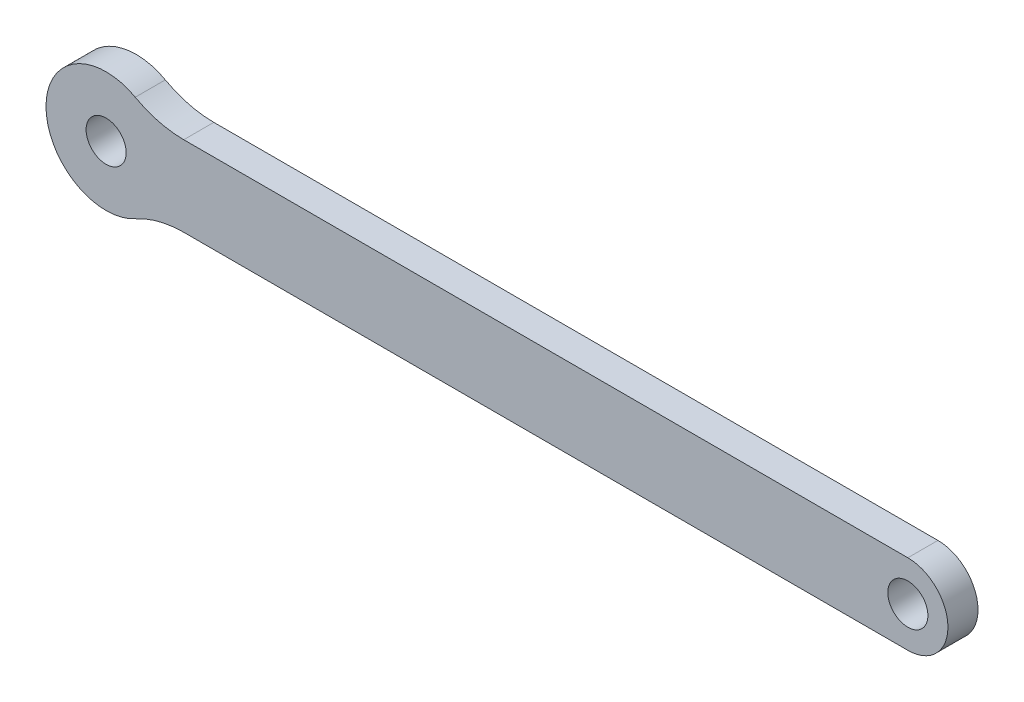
ISO-10303-21;
HEADER;
FILE_DESCRIPTION(('STEP AP214'),'2;1');
FILE_NAME('part.step','',(''),(''),'','','');
FILE_SCHEMA(('AUTOMOTIVE_DESIGN { 1 0 10303 214 1 1 1 1 }'));
ENDSEC;
DATA;
#1=APPLICATION_CONTEXT('core data for automotive mechanical design processes');
#2=APPLICATION_PROTOCOL_DEFINITION('international standard','automotive_design',2000,#1);
#3=PRODUCT_CONTEXT('',#1,'mechanical');
#4=PRODUCT('Part','Part','',(#3));
#5=PRODUCT_RELATED_PRODUCT_CATEGORY('part','',(#4));
#6=PRODUCT_DEFINITION_FORMATION('','',#4);
#7=PRODUCT_DEFINITION_CONTEXT('part definition',#1,'design');
#8=PRODUCT_DEFINITION('design','',#6,#7);
#9=PRODUCT_DEFINITION_SHAPE('','',#8);
#10=(LENGTH_UNIT() NAMED_UNIT(*) SI_UNIT(.MILLI.,.METRE.));
#11=(NAMED_UNIT(*) PLANE_ANGLE_UNIT() SI_UNIT($,.RADIAN.));
#12=(NAMED_UNIT(*) SI_UNIT($,.STERADIAN.) SOLID_ANGLE_UNIT());
#13=UNCERTAINTY_MEASURE_WITH_UNIT(LENGTH_MEASURE(1.E-05),#10,'distance_accuracy_value','');
#14=(GEOMETRIC_REPRESENTATION_CONTEXT(3) GLOBAL_UNCERTAINTY_ASSIGNED_CONTEXT((#13)) GLOBAL_UNIT_ASSIGNED_CONTEXT((#10,
#11,#12)) REPRESENTATION_CONTEXT('',''));
#15=CARTESIAN_POINT('',(0.,0.,0.));
#16=DIRECTION('',(0.,0.,1.));
#17=DIRECTION('',(1.,0.,0.));
#18=AXIS2_PLACEMENT_3D('',#15,#16,#17);
#19=CARTESIAN_POINT('',(126.393109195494,47.5642070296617,0.));
#20=DIRECTION('',(0.,0.,-1.));
#21=DIRECTION('',(-1.,0.,0.));
#22=AXIS2_PLACEMENT_3D('',#19,#20,#21);
#23=PLANE('',#22);
#24=CARTESIAN_POINT('',(198.647142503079,61.5642070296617,0.));
#25=DIRECTION('',(0.,0.,1.));
#26=DIRECTION('',(1.,0.,0.));
#27=AXIS2_PLACEMENT_3D('',#24,#25,#26);
#28=CIRCLE('',#27,2.);
#29=CARTESIAN_POINT('',(200.647142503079,61.5642070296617,0.));
#30=VERTEX_POINT('',#29);
#31=EDGE_CURVE('E148',#30,#30,#28,.T.);
#32=ORIENTED_EDGE('',*,*,#31,.T.);
#33=EDGE_LOOP('',(#32));
#34=FACE_BOUND('',#33,.T.);
#35=CARTESIAN_POINT('',(118.647142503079,61.5642070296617,0.));
#36=DIRECTION('',(0.,0.,1.));
#37=DIRECTION('',(1.,0.,0.));
#38=AXIS2_PLACEMENT_3D('',#35,#36,#37);
#39=CIRCLE('',#38,2.);
#40=CARTESIAN_POINT('',(120.647142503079,61.5642070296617,0.));
#41=VERTEX_POINT('',#40);
#42=EDGE_CURVE('E95',#41,#41,#39,.T.);
#43=ORIENTED_EDGE('',*,*,#42,.T.);
#44=EDGE_LOOP('',(#43));
#45=FACE_BOUND('',#44,.T.);
#46=CARTESIAN_POINT('',(198.647142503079,61.5642070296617,0.));
#47=DIRECTION('',(0.,0.,-1.));
#48=DIRECTION('',(-1.,0.,0.));
#49=AXIS2_PLACEMENT_3D('',#46,#47,#48);
#50=CIRCLE('',#49,4.);
#51=CARTESIAN_POINT('',(198.647142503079,57.5642070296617,0.));
#52=VERTEX_POINT('',#51);
#53=CARTESIAN_POINT('',(198.647142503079,65.5642070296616,0.));
#54=VERTEX_POINT('',#53);
#55=EDGE_CURVE('E115',#52,#54,#50,.F.);
#56=ORIENTED_EDGE('',*,*,#55,.F.);
#57=DIRECTION('',(-1.,0.,0.));
#58=VECTOR('',#57,1.);
#59=CARTESIAN_POINT('',(126.393109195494,57.5642070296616,0.));
#60=LINE('',#59,#58);
#61=CARTESIAN_POINT('',(126.393109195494,57.5642070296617,0.));
#62=VERTEX_POINT('',#61);
#63=EDGE_CURVE('E109',#52,#62,#60,.T.);
#64=ORIENTED_EDGE('',*,*,#63,.T.);
#65=CARTESIAN_POINT('',(126.393109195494,47.5642070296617,0.));
#66=DIRECTION('',(0.,0.,-1.));
#67=DIRECTION('',(-1.,0.,0.));
#68=AXIS2_PLACEMENT_3D('',#65,#66,#67);
#69=CIRCLE('',#68,10.);
#70=CARTESIAN_POINT('',(121.551880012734,56.3142070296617,0.));
#71=VERTEX_POINT('',#70);
#72=EDGE_CURVE('E89',#62,#71,#69,.F.);
#73=ORIENTED_EDGE('',*,*,#72,.T.);
#74=CARTESIAN_POINT('',(118.647142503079,61.5642070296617,0.));
#75=DIRECTION('',(0.,0.,-1.));
#76=DIRECTION('',(-1.,0.,0.));
#77=AXIS2_PLACEMENT_3D('',#74,#75,#76);
#78=CIRCLE('',#77,6.00000000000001);
#79=CARTESIAN_POINT('',(112.647142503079,61.5642070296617,0.));
#80=VERTEX_POINT('',#79);
#81=EDGE_CURVE('E33',#80,#71,#78,.F.);
#82=ORIENTED_EDGE('',*,*,#81,.F.);
#83=CARTESIAN_POINT('',(118.647142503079,61.5642070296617,0.));
#84=DIRECTION('',(0.,0.,-1.));
#85=DIRECTION('',(-1.,0.,0.));
#86=AXIS2_PLACEMENT_3D('',#83,#84,#85);
#87=CIRCLE('',#86,6.00000000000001);
#88=CARTESIAN_POINT('',(121.551880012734,66.8142070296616,0.));
#89=VERTEX_POINT('',#88);
#90=EDGE_CURVE('E87',#89,#80,#87,.F.);
#91=ORIENTED_EDGE('',*,*,#90,.F.);
#92=CARTESIAN_POINT('',(126.393109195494,75.5642070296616,0.));
#93=DIRECTION('',(0.,0.,-1.));
#94=DIRECTION('',(-1.,0.,0.));
#95=AXIS2_PLACEMENT_3D('',#92,#93,#94);
#96=CIRCLE('',#95,10.);
#97=CARTESIAN_POINT('',(126.393109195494,65.5642070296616,0.));
#98=VERTEX_POINT('',#97);
#99=EDGE_CURVE('E131',#89,#98,#96,.F.);
#100=ORIENTED_EDGE('',*,*,#99,.T.);
#101=DIRECTION('',(1.,0.,0.));
#102=VECTOR('',#101,1.);
#103=CARTESIAN_POINT('',(198.647142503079,65.5642070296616,0.));
#104=LINE('',#103,#102);
#105=EDGE_CURVE('E113',#98,#54,#104,.T.);
#106=ORIENTED_EDGE('',*,*,#105,.T.);
#107=EDGE_LOOP('',(#56,#64,#73,#82,#91,#100,#106));
#108=FACE_BOUND('',#107,.T.);
#109=ADVANCED_FACE('F30',(#34,#45,#108),#23,.T.);
#110=CARTESIAN_POINT('',(118.647142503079,61.5642070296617,3.));
#111=DIRECTION('',(0.,0.,-1.));
#112=DIRECTION('',(-1.,0.,0.));
#113=AXIS2_PLACEMENT_3D('',#110,#111,#112);
#114=CYLINDRICAL_SURFACE('',#113,6.00000000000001);
#115=ORIENTED_EDGE('',*,*,#81,.T.);
#116=DIRECTION('',(0.,0.,-1.));
#117=VECTOR('',#116,1.);
#118=CARTESIAN_POINT('',(121.551880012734,56.3142070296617,3.));
#119=LINE('',#118,#117);
#120=CARTESIAN_POINT('',(121.551880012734,56.3142070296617,3.));
#121=VERTEX_POINT('',#120);
#122=EDGE_CURVE('E111',#71,#121,#119,.F.);
#123=ORIENTED_EDGE('',*,*,#122,.T.);
#124=CARTESIAN_POINT('',(118.647142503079,61.5642070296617,3.));
#125=DIRECTION('',(0.,0.,-1.));
#126=DIRECTION('',(-1.,0.,0.));
#127=AXIS2_PLACEMENT_3D('',#124,#125,#126);
#128=CIRCLE('',#127,6.00000000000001);
#129=CARTESIAN_POINT('',(112.647142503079,61.5642070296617,3.));
#130=VERTEX_POINT('',#129);
#131=EDGE_CURVE('E104',#121,#130,#128,.T.);
#132=ORIENTED_EDGE('',*,*,#131,.T.);
#133=DIRECTION('',(0.,0.,-1.));
#134=VECTOR('',#133,1.);
#135=CARTESIAN_POINT('',(112.647142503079,61.5642070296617,3.));
#136=LINE('',#135,#134);
#137=EDGE_CURVE('E94',#80,#130,#136,.F.);
#138=ORIENTED_EDGE('',*,*,#137,.F.);
#139=EDGE_LOOP('',(#115,#123,#132,#138));
#140=FACE_BOUND('',#139,.T.);
#141=ADVANCED_FACE('F103',(#140),#114,.T.);
#142=CARTESIAN_POINT('',(118.647142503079,61.5642070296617,3.));
#143=DIRECTION('',(0.,0.,-1.));
#144=DIRECTION('',(-1.,0.,0.));
#145=AXIS2_PLACEMENT_3D('',#142,#143,#144);
#146=CYLINDRICAL_SURFACE('',#145,6.00000000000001);
#147=DIRECTION('',(0.,0.,-1.));
#148=VECTOR('',#147,1.);
#149=CARTESIAN_POINT('',(121.551880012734,66.8142070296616,3.));
#150=LINE('',#149,#148);
#151=CARTESIAN_POINT('',(121.551880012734,66.8142070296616,3.));
#152=VERTEX_POINT('',#151);
#153=EDGE_CURVE('E101',#152,#89,#150,.T.);
#154=ORIENTED_EDGE('',*,*,#153,.T.);
#155=ORIENTED_EDGE('',*,*,#90,.T.);
#156=ORIENTED_EDGE('',*,*,#137,.T.);
#157=CARTESIAN_POINT('',(118.647142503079,61.5642070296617,3.));
#158=DIRECTION('',(0.,0.,-1.));
#159=DIRECTION('',(-1.,0.,0.));
#160=AXIS2_PLACEMENT_3D('',#157,#158,#159);
#161=CIRCLE('',#160,6.00000000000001);
#162=EDGE_CURVE('E125',#130,#152,#161,.T.);
#163=ORIENTED_EDGE('',*,*,#162,.T.);
#164=EDGE_LOOP('',(#154,#155,#156,#163));
#165=FACE_BOUND('',#164,.T.);
#166=ADVANCED_FACE('F98',(#165),#146,.T.);
#167=CARTESIAN_POINT('',(126.393109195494,75.5642070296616,3.));
#168=DIRECTION('',(0.,0.,-1.));
#169=DIRECTION('',(-1.,0.,0.));
#170=AXIS2_PLACEMENT_3D('',#167,#168,#169);
#171=CYLINDRICAL_SURFACE('',#170,10.);
#172=ORIENTED_EDGE('',*,*,#153,.F.);
#173=CARTESIAN_POINT('',(126.393109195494,75.5642070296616,3.));
#174=DIRECTION('',(0.,0.,-1.));
#175=DIRECTION('',(-1.,0.,0.));
#176=AXIS2_PLACEMENT_3D('',#173,#174,#175);
#177=CIRCLE('',#176,10.);
#178=CARTESIAN_POINT('',(126.393109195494,65.5642070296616,3.));
#179=VERTEX_POINT('',#178);
#180=EDGE_CURVE('E122',#152,#179,#177,.F.);
#181=ORIENTED_EDGE('',*,*,#180,.T.);
#182=DIRECTION('',(0.,0.,1.));
#183=VECTOR('',#182,1.);
#184=CARTESIAN_POINT('',(126.393109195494,65.5642070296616,3.));
#185=LINE('',#184,#183);
#186=EDGE_CURVE('E116',#179,#98,#185,.F.);
#187=ORIENTED_EDGE('',*,*,#186,.T.);
#188=ORIENTED_EDGE('',*,*,#99,.F.);
#189=EDGE_LOOP('',(#172,#181,#187,#188));
#190=FACE_BOUND('',#189,.T.);
#191=ADVANCED_FACE('F183',(#190),#171,.F.);
#192=CARTESIAN_POINT('',(198.647142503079,65.5642070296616,3.));
#193=DIRECTION('',(0.,-1.,0.));
#194=DIRECTION('',(1.,0.,0.));
#195=AXIS2_PLACEMENT_3D('',#192,#193,#194);
#196=PLANE('',#195);
#197=ORIENTED_EDGE('',*,*,#186,.F.);
#198=DIRECTION('',(-1.,0.,0.));
#199=VECTOR('',#198,1.);
#200=CARTESIAN_POINT('',(126.393109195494,65.5642070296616,3.));
#201=LINE('',#200,#199);
#202=CARTESIAN_POINT('',(198.647142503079,65.5642070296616,3.));
#203=VERTEX_POINT('',#202);
#204=EDGE_CURVE('E121',#179,#203,#201,.F.);
#205=ORIENTED_EDGE('',*,*,#204,.T.);
#206=DIRECTION('',(0.,0.,-1.));
#207=VECTOR('',#206,1.);
#208=CARTESIAN_POINT('',(198.647142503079,65.5642070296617,3.));
#209=LINE('',#208,#207);
#210=EDGE_CURVE('E130',#54,#203,#209,.F.);
#211=ORIENTED_EDGE('',*,*,#210,.F.);
#212=ORIENTED_EDGE('',*,*,#105,.F.);
#213=EDGE_LOOP('',(#197,#205,#211,#212));
#214=FACE_BOUND('',#213,.T.);
#215=ADVANCED_FACE('F181',(#214),#196,.F.);
#216=CARTESIAN_POINT('',(198.647142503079,61.5642070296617,3.));
#217=DIRECTION('',(0.,0.,-1.));
#218=DIRECTION('',(-1.,0.,0.));
#219=AXIS2_PLACEMENT_3D('',#216,#217,#218);
#220=CYLINDRICAL_SURFACE('',#219,4.);
#221=CARTESIAN_POINT('',(198.647142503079,61.5642070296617,3.));
#222=DIRECTION('',(0.,0.,-1.));
#223=DIRECTION('',(-1.,0.,0.));
#224=AXIS2_PLACEMENT_3D('',#221,#222,#223);
#225=CIRCLE('',#224,4.);
#226=CARTESIAN_POINT('',(198.647142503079,57.5642070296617,3.));
#227=VERTEX_POINT('',#226);
#228=EDGE_CURVE('E118',#203,#227,#225,.T.);
#229=ORIENTED_EDGE('',*,*,#228,.T.);
#230=DIRECTION('',(0.,0.,1.));
#231=VECTOR('',#230,1.);
#232=CARTESIAN_POINT('',(198.647142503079,57.5642070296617,3.));
#233=LINE('',#232,#231);
#234=EDGE_CURVE('E112',#227,#52,#233,.F.);
#235=ORIENTED_EDGE('',*,*,#234,.T.);
#236=ORIENTED_EDGE('',*,*,#55,.T.);
#237=ORIENTED_EDGE('',*,*,#210,.T.);
#238=EDGE_LOOP('',(#229,#235,#236,#237));
#239=FACE_BOUND('',#238,.T.);
#240=ADVANCED_FACE('F178',(#239),#220,.T.);
#241=CARTESIAN_POINT('',(126.393109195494,57.5642070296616,3.));
#242=DIRECTION('',(0.,1.,0.));
#243=DIRECTION('',(-1.,0.,0.));
#244=AXIS2_PLACEMENT_3D('',#241,#242,#243);
#245=PLANE('',#244);
#246=ORIENTED_EDGE('',*,*,#234,.F.);
#247=DIRECTION('',(-1.,0.,0.));
#248=VECTOR('',#247,1.);
#249=CARTESIAN_POINT('',(126.393109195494,57.5642070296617,3.));
#250=LINE('',#249,#248);
#251=CARTESIAN_POINT('',(126.393109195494,57.5642070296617,3.));
#252=VERTEX_POINT('',#251);
#253=EDGE_CURVE('E39',#227,#252,#250,.T.);
#254=ORIENTED_EDGE('',*,*,#253,.T.);
#255=DIRECTION('',(0.,0.,-1.));
#256=VECTOR('',#255,1.);
#257=CARTESIAN_POINT('',(126.393109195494,57.5642070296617,3.));
#258=LINE('',#257,#256);
#259=EDGE_CURVE('E47',#252,#62,#258,.T.);
#260=ORIENTED_EDGE('',*,*,#259,.T.);
#261=ORIENTED_EDGE('',*,*,#63,.F.);
#262=EDGE_LOOP('',(#246,#254,#260,#261));
#263=FACE_BOUND('',#262,.T.);
#264=ADVANCED_FACE('F209',(#263),#245,.F.);
#265=CARTESIAN_POINT('',(126.393109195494,47.5642070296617,3.));
#266=DIRECTION('',(0.,0.,-1.));
#267=DIRECTION('',(-1.,0.,0.));
#268=AXIS2_PLACEMENT_3D('',#265,#266,#267);
#269=CYLINDRICAL_SURFACE('',#268,10.);
#270=ORIENTED_EDGE('',*,*,#259,.F.);
#271=CARTESIAN_POINT('',(126.393109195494,47.5642070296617,3.));
#272=DIRECTION('',(0.,0.,-1.));
#273=DIRECTION('',(-1.,0.,0.));
#274=AXIS2_PLACEMENT_3D('',#271,#272,#273);
#275=CIRCLE('',#274,10.);
#276=EDGE_CURVE('E11',#252,#121,#275,.F.);
#277=ORIENTED_EDGE('',*,*,#276,.T.);
#278=ORIENTED_EDGE('',*,*,#122,.F.);
#279=ORIENTED_EDGE('',*,*,#72,.F.);
#280=EDGE_LOOP('',(#270,#277,#278,#279));
#281=FACE_BOUND('',#280,.T.);
#282=ADVANCED_FACE('F169',(#281),#269,.F.);
#283=CARTESIAN_POINT('',(126.393109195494,47.5642070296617,3.));
#284=DIRECTION('',(0.,0.,-1.));
#285=DIRECTION('',(-1.,0.,0.));
#286=AXIS2_PLACEMENT_3D('',#283,#284,#285);
#287=PLANE('',#286);
#288=CARTESIAN_POINT('',(198.647142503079,61.5642070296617,3.));
#289=DIRECTION('',(0.,0.,1.));
#290=DIRECTION('',(1.,0.,0.));
#291=AXIS2_PLACEMENT_3D('',#288,#289,#290);
#292=CIRCLE('',#291,2.);
#293=CARTESIAN_POINT('',(200.647142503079,61.5642070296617,3.));
#294=VERTEX_POINT('',#293);
#295=EDGE_CURVE('E151',#294,#294,#292,.T.);
#296=ORIENTED_EDGE('',*,*,#295,.F.);
#297=EDGE_LOOP('',(#296));
#298=FACE_BOUND('',#297,.T.);
#299=CARTESIAN_POINT('',(118.647142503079,61.5642070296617,3.));
#300=DIRECTION('',(0.,0.,1.));
#301=DIRECTION('',(1.,0.,0.));
#302=AXIS2_PLACEMENT_3D('',#299,#300,#301);
#303=CIRCLE('',#302,2.);
#304=CARTESIAN_POINT('',(120.647142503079,61.5642070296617,3.));
#305=VERTEX_POINT('',#304);
#306=EDGE_CURVE('E145',#305,#305,#303,.T.);
#307=ORIENTED_EDGE('',*,*,#306,.F.);
#308=EDGE_LOOP('',(#307));
#309=FACE_BOUND('',#308,.T.);
#310=ORIENTED_EDGE('',*,*,#253,.F.);
#311=ORIENTED_EDGE('',*,*,#228,.F.);
#312=ORIENTED_EDGE('',*,*,#204,.F.);
#313=ORIENTED_EDGE('',*,*,#180,.F.);
#314=ORIENTED_EDGE('',*,*,#162,.F.);
#315=ORIENTED_EDGE('',*,*,#131,.F.);
#316=ORIENTED_EDGE('',*,*,#276,.F.);
#317=EDGE_LOOP('',(#310,#311,#312,#313,#314,#315,#316));
#318=FACE_BOUND('',#317,.T.);
#319=ADVANCED_FACE('F166',(#298,#309,#318),#287,.F.);
#320=CARTESIAN_POINT('',(118.647142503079,61.5642070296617,0.));
#321=DIRECTION('',(0.,0.,1.));
#322=DIRECTION('',(1.,0.,0.));
#323=AXIS2_PLACEMENT_3D('',#320,#321,#322);
#324=CYLINDRICAL_SURFACE('',#323,2.);
#325=ORIENTED_EDGE('',*,*,#42,.F.);
#326=EDGE_LOOP('',(#325));
#327=FACE_BOUND('',#326,.T.);
#328=ORIENTED_EDGE('',*,*,#306,.T.);
#329=EDGE_LOOP('',(#328));
#330=FACE_BOUND('',#329,.T.);
#331=ADVANCED_FACE('F162',(#327,#330),#324,.F.);
#332=CARTESIAN_POINT('',(198.647142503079,61.5642070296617,0.));
#333=DIRECTION('',(0.,0.,1.));
#334=DIRECTION('',(1.,0.,0.));
#335=AXIS2_PLACEMENT_3D('',#332,#333,#334);
#336=CYLINDRICAL_SURFACE('',#335,2.);
#337=ORIENTED_EDGE('',*,*,#31,.F.);
#338=EDGE_LOOP('',(#337));
#339=FACE_BOUND('',#338,.T.);
#340=ORIENTED_EDGE('',*,*,#295,.T.);
#341=EDGE_LOOP('',(#340));
#342=FACE_BOUND('',#341,.T.);
#343=ADVANCED_FACE('F159',(#339,#342),#336,.F.);
#344=CLOSED_SHELL('',(#109,#141,#166,#191,#215,#240,#264,#282,#319,#331,#343));
#345=MANIFOLD_SOLID_BREP('B2',#344);
#346=ADVANCED_BREP_SHAPE_REPRESENTATION('',(#18,#345),#14);
#347=SHAPE_DEFINITION_REPRESENTATION(#9,#346);
ENDSEC;
END-ISO-10303-21;
